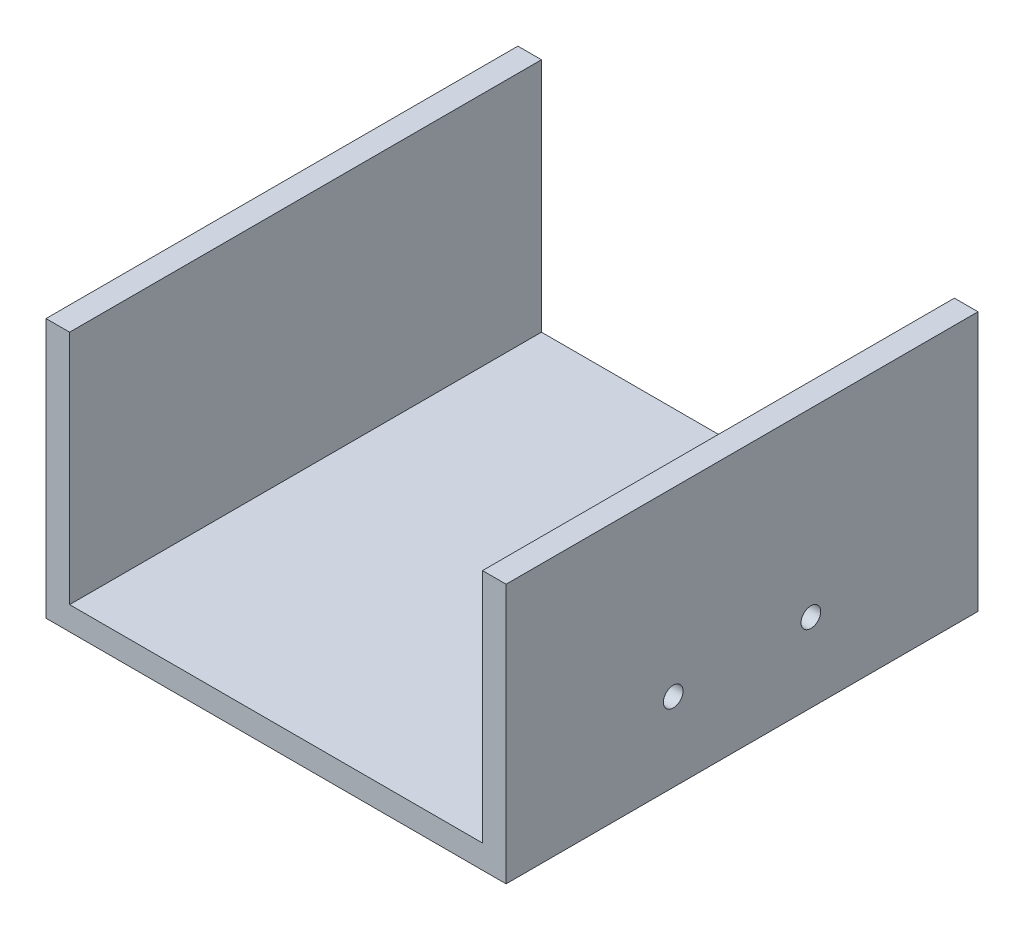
from build123d import *

# Parameters (mm, degrees)
EXTRUSION1_DEPTH      = 120
TROU_TARAUD_M61_D     = 5
TROU_TARAUD_M61_DEPTH = 17
TROU_TARAUD_M61_TIP   = 1.502151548


with BuildPart() as part:
    # Esquisse1 → Extrusion1 (new body)
    with BuildSketch(Plane.XY):
        Polygon((-52.5, -27), (52.5, -27), (52.5, 33), (58.5, 33), (58.5, -33), (-58.5, -33), (-58.5, 33), (-52.5, 33), align=None)
    extrude(amount=EXTRUSION1_DEPTH)

    # Trou taraud_ M61
    with Locations(Plane(origin=(58.5, 0, 0), x_dir=(0, 0, -1), z_dir=(1, 0, 0))):
        with Locations((-42.5, -13), (-77.5, -13)):
            Hole(TROU_TARAUD_M61_D / 2, depth=TROU_TARAUD_M61_DEPTH)
            with Locations((0, 0, -(TROU_TARAUD_M61_DEPTH + TROU_TARAUD_M61_TIP / 2))):  # 118° drill point
                Cone(0, TROU_TARAUD_M61_D / 2, TROU_TARAUD_M61_TIP, mode=Mode.SUBTRACT)


solid = part.part
